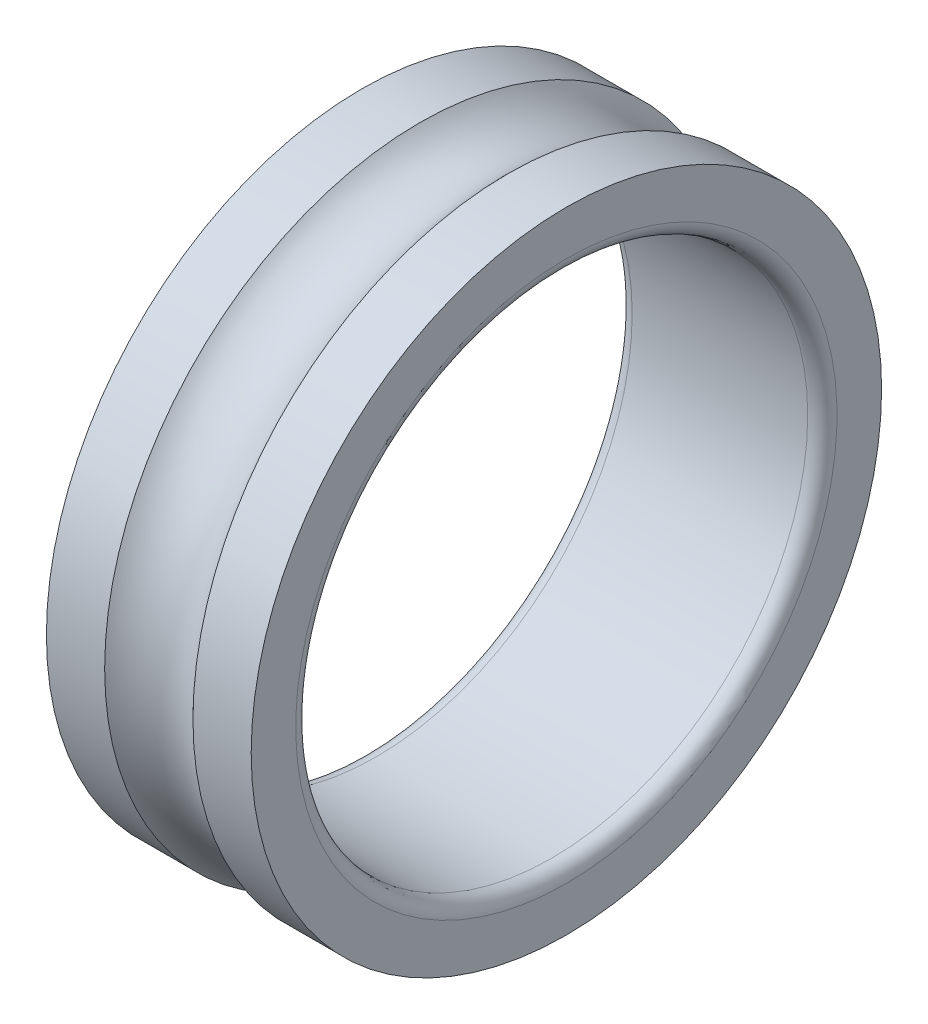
ISO-10303-21;
HEADER;
FILE_DESCRIPTION(('STEP AP214'),'2;1');
FILE_NAME('part.step','',(''),(''),'','','');
FILE_SCHEMA(('AUTOMOTIVE_DESIGN { 1 0 10303 214 1 1 1 1 }'));
ENDSEC;
DATA;
#1=APPLICATION_CONTEXT('core data for automotive mechanical design processes');
#2=APPLICATION_PROTOCOL_DEFINITION('international standard','automotive_design',2000,#1);
#3=PRODUCT_CONTEXT('',#1,'mechanical');
#4=PRODUCT('Part','Part','',(#3));
#5=PRODUCT_RELATED_PRODUCT_CATEGORY('part','',(#4));
#6=PRODUCT_DEFINITION_FORMATION('','',#4);
#7=PRODUCT_DEFINITION_CONTEXT('part definition',#1,'design');
#8=PRODUCT_DEFINITION('design','',#6,#7);
#9=PRODUCT_DEFINITION_SHAPE('','',#8);
#10=(LENGTH_UNIT() NAMED_UNIT(*) SI_UNIT(.MILLI.,.METRE.));
#11=(NAMED_UNIT(*) PLANE_ANGLE_UNIT() SI_UNIT($,.RADIAN.));
#12=(NAMED_UNIT(*) SI_UNIT($,.STERADIAN.) SOLID_ANGLE_UNIT());
#13=UNCERTAINTY_MEASURE_WITH_UNIT(LENGTH_MEASURE(1.E-05),#10,'distance_accuracy_value','');
#14=(GEOMETRIC_REPRESENTATION_CONTEXT(3) GLOBAL_UNCERTAINTY_ASSIGNED_CONTEXT((#13)) GLOBAL_UNIT_ASSIGNED_CONTEXT((#10,
#11,#12)) REPRESENTATION_CONTEXT('',''));
#15=CARTESIAN_POINT('',(0.,0.,0.));
#16=DIRECTION('',(0.,0.,1.));
#17=DIRECTION('',(1.,0.,0.));
#18=AXIS2_PLACEMENT_3D('',#15,#16,#17);
#19=CARTESIAN_POINT('',(1.,0.,0.));
#20=DIRECTION('',(-1.,0.,0.));
#21=DIRECTION('',(0.,-1.,0.));
#22=AXIS2_PLACEMENT_3D('',#19,#20,#21);
#23=TOROIDAL_SURFACE('',#22,18.5,1.);
#24=CARTESIAN_POINT('',(1.,0.,0.));
#25=DIRECTION('',(-1.,0.,0.));
#26=DIRECTION('',(0.,-1.,0.));
#27=AXIS2_PLACEMENT_3D('',#24,#25,#26);
#28=CIRCLE('',#27,17.5);
#29=CARTESIAN_POINT('',(1.,-17.5,0.));
#30=VERTEX_POINT('',#29);
#31=EDGE_CURVE('E10',#30,#30,#28,.T.);
#32=ORIENTED_EDGE('',*,*,#31,.F.);
#33=EDGE_LOOP('',(#32));
#34=FACE_BOUND('',#33,.T.);
#35=CARTESIAN_POINT('',(0.,0.,0.));
#36=DIRECTION('',(-1.,0.,0.));
#37=DIRECTION('',(0.,-1.,0.));
#38=AXIS2_PLACEMENT_3D('',#35,#36,#37);
#39=CIRCLE('',#38,18.5);
#40=CARTESIAN_POINT('',(0.,-18.5,0.));
#41=VERTEX_POINT('',#40);
#42=EDGE_CURVE('E58',#41,#41,#39,.T.);
#43=ORIENTED_EDGE('',*,*,#42,.T.);
#44=EDGE_LOOP('',(#43));
#45=FACE_BOUND('',#44,.T.);
#46=ADVANCED_FACE('F30',(#34,#45),#23,.T.);
#47=CARTESIAN_POINT('',(0.,0.,0.));
#48=DIRECTION('',(-1.,0.,0.));
#49=DIRECTION('',(0.,-1.,0.));
#50=AXIS2_PLACEMENT_3D('',#47,#48,#49);
#51=CYLINDRICAL_SURFACE('',#50,17.5);
#52=CARTESIAN_POINT('',(13.,0.,0.));
#53=DIRECTION('',(-1.,0.,0.));
#54=DIRECTION('',(0.,-1.,0.));
#55=AXIS2_PLACEMENT_3D('',#52,#53,#54);
#56=CIRCLE('',#55,17.5);
#57=CARTESIAN_POINT('',(13.,-17.5,0.));
#58=VERTEX_POINT('',#57);
#59=EDGE_CURVE('E36',#58,#58,#56,.T.);
#60=ORIENTED_EDGE('',*,*,#59,.F.);
#61=EDGE_LOOP('',(#60));
#62=FACE_BOUND('',#61,.T.);
#63=ORIENTED_EDGE('',*,*,#31,.T.);
#64=EDGE_LOOP('',(#63));
#65=FACE_BOUND('',#64,.T.);
#66=ADVANCED_FACE('F95',(#62,#65),#51,.F.);
#67=CARTESIAN_POINT('',(13.,0.,0.));
#68=DIRECTION('',(-1.,0.,0.));
#69=DIRECTION('',(0.,-1.,0.));
#70=AXIS2_PLACEMENT_3D('',#67,#68,#69);
#71=TOROIDAL_SURFACE('',#70,18.5,1.);
#72=CARTESIAN_POINT('',(14.,0.,0.));
#73=DIRECTION('',(-1.,0.,0.));
#74=DIRECTION('',(0.,-1.,0.));
#75=AXIS2_PLACEMENT_3D('',#72,#73,#74);
#76=CIRCLE('',#75,18.5);
#77=CARTESIAN_POINT('',(14.,-18.5,0.));
#78=VERTEX_POINT('',#77);
#79=EDGE_CURVE('E40',#78,#78,#76,.T.);
#80=ORIENTED_EDGE('',*,*,#79,.F.);
#81=EDGE_LOOP('',(#80));
#82=FACE_BOUND('',#81,.T.);
#83=ORIENTED_EDGE('',*,*,#59,.T.);
#84=EDGE_LOOP('',(#83));
#85=FACE_BOUND('',#84,.T.);
#86=ADVANCED_FACE('F90',(#82,#85),#71,.T.);
#87=CARTESIAN_POINT('',(14.,21.55,0.));
#88=DIRECTION('',(-1.,0.,0.));
#89=DIRECTION('',(0.,-1.,0.));
#90=AXIS2_PLACEMENT_3D('',#87,#88,#89);
#91=PLANE('',#90);
#92=CARTESIAN_POINT('',(14.,0.,0.));
#93=DIRECTION('',(-1.,0.,0.));
#94=DIRECTION('',(0.,-1.,0.));
#95=AXIS2_PLACEMENT_3D('',#92,#93,#94);
#96=CIRCLE('',#95,21.55);
#97=CARTESIAN_POINT('',(14.,-21.55,0.));
#98=VERTEX_POINT('',#97);
#99=EDGE_CURVE('E44',#98,#98,#96,.T.);
#100=ORIENTED_EDGE('',*,*,#99,.F.);
#101=EDGE_LOOP('',(#100));
#102=FACE_BOUND('',#101,.T.);
#103=ORIENTED_EDGE('',*,*,#79,.T.);
#104=EDGE_LOOP('',(#103));
#105=FACE_BOUND('',#104,.T.);
#106=ADVANCED_FACE('F84',(#102,#105),#91,.F.);
#107=CARTESIAN_POINT('',(0.,0.,0.));
#108=DIRECTION('',(-1.,0.,0.));
#109=DIRECTION('',(0.,-1.,0.));
#110=AXIS2_PLACEMENT_3D('',#107,#108,#109);
#111=CYLINDRICAL_SURFACE('',#110,21.55);
#112=CARTESIAN_POINT('',(10.0186917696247,0.,0.));
#113=DIRECTION('',(-1.,0.,0.));
#114=DIRECTION('',(0.,-1.,0.));
#115=AXIS2_PLACEMENT_3D('',#112,#113,#114);
#116=CIRCLE('',#115,21.55);
#117=CARTESIAN_POINT('',(10.0186917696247,-21.55,0.));
#118=VERTEX_POINT('',#117);
#119=EDGE_CURVE('E49',#118,#118,#116,.T.);
#120=ORIENTED_EDGE('',*,*,#119,.F.);
#121=EDGE_LOOP('',(#120));
#122=FACE_BOUND('',#121,.T.);
#123=ORIENTED_EDGE('',*,*,#99,.T.);
#124=EDGE_LOOP('',(#123));
#125=FACE_BOUND('',#124,.T.);
#126=ADVANCED_FACE('F78',(#122,#125),#111,.T.);
#127=CARTESIAN_POINT('',(7.00000000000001,0.,0.));
#128=DIRECTION('',(-1.,0.,0.));
#129=DIRECTION('',(0.,-1.,0.));
#130=AXIS2_PLACEMENT_3D('',#127,#128,#129);
#131=TOROIDAL_SURFACE('',#130,24.25,4.05);
#132=CARTESIAN_POINT('',(3.98130823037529,0.,0.));
#133=DIRECTION('',(-1.,0.,0.));
#134=DIRECTION('',(0.,-1.,0.));
#135=AXIS2_PLACEMENT_3D('',#132,#133,#134);
#136=CIRCLE('',#135,21.55);
#137=CARTESIAN_POINT('',(3.98130823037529,-21.55,0.));
#138=VERTEX_POINT('',#137);
#139=EDGE_CURVE('E52',#138,#138,#136,.T.);
#140=ORIENTED_EDGE('',*,*,#139,.F.);
#141=EDGE_LOOP('',(#140));
#142=FACE_BOUND('',#141,.T.);
#143=ORIENTED_EDGE('',*,*,#119,.T.);
#144=EDGE_LOOP('',(#143));
#145=FACE_BOUND('',#144,.T.);
#146=ADVANCED_FACE('F72',(#142,#145),#131,.F.);
#147=CARTESIAN_POINT('',(0.,0.,0.));
#148=DIRECTION('',(-1.,0.,0.));
#149=DIRECTION('',(0.,-1.,0.));
#150=AXIS2_PLACEMENT_3D('',#147,#148,#149);
#151=CYLINDRICAL_SURFACE('',#150,21.55);
#152=CARTESIAN_POINT('',(0.,0.,0.));
#153=DIRECTION('',(-1.,0.,0.));
#154=DIRECTION('',(0.,-1.,0.));
#155=AXIS2_PLACEMENT_3D('',#152,#153,#154);
#156=CIRCLE('',#155,21.55);
#157=CARTESIAN_POINT('',(0.,-21.55,0.));
#158=VERTEX_POINT('',#157);
#159=EDGE_CURVE('E55',#158,#158,#156,.T.);
#160=ORIENTED_EDGE('',*,*,#159,.F.);
#161=EDGE_LOOP('',(#160));
#162=FACE_BOUND('',#161,.T.);
#163=ORIENTED_EDGE('',*,*,#139,.T.);
#164=EDGE_LOOP('',(#163));
#165=FACE_BOUND('',#164,.T.);
#166=ADVANCED_FACE('F66',(#162,#165),#151,.T.);
#167=CARTESIAN_POINT('',(0.,21.55,0.));
#168=DIRECTION('',(1.,0.,0.));
#169=DIRECTION('',(0.,1.,0.));
#170=AXIS2_PLACEMENT_3D('',#167,#168,#169);
#171=PLANE('',#170);
#172=ORIENTED_EDGE('',*,*,#42,.F.);
#173=EDGE_LOOP('',(#172));
#174=FACE_BOUND('',#173,.T.);
#175=ORIENTED_EDGE('',*,*,#159,.T.);
#176=EDGE_LOOP('',(#175));
#177=FACE_BOUND('',#176,.T.);
#178=ADVANCED_FACE('F63',(#174,#177),#171,.F.);
#179=CLOSED_SHELL('',(#46,#66,#86,#106,#126,#146,#166,#178));
#180=MANIFOLD_SOLID_BREP('B2',#179);
#181=ADVANCED_BREP_SHAPE_REPRESENTATION('',(#18,#180),#14);
#182=SHAPE_DEFINITION_REPRESENTATION(#9,#181);
ENDSEC;
END-ISO-10303-21;
